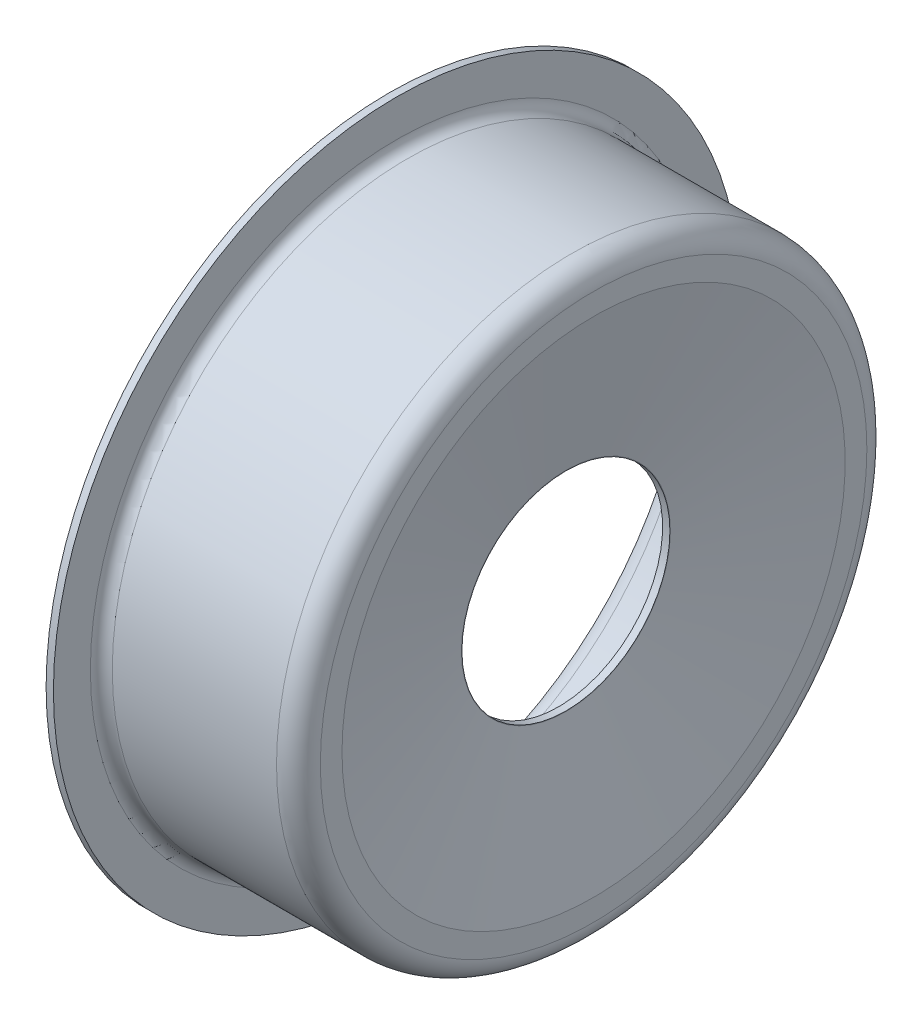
ISO-10303-21;
HEADER;
FILE_DESCRIPTION(('STEP AP214'),'2;1');
FILE_NAME('part.step','',(''),(''),'','','');
FILE_SCHEMA(('AUTOMOTIVE_DESIGN { 1 0 10303 214 1 1 1 1 }'));
ENDSEC;
DATA;
#1=APPLICATION_CONTEXT('core data for automotive mechanical design processes');
#2=APPLICATION_PROTOCOL_DEFINITION('international standard','automotive_design',2000,#1);
#3=PRODUCT_CONTEXT('',#1,'mechanical');
#4=PRODUCT('Part','Part','',(#3));
#5=PRODUCT_RELATED_PRODUCT_CATEGORY('part','',(#4));
#6=PRODUCT_DEFINITION_FORMATION('','',#4);
#7=PRODUCT_DEFINITION_CONTEXT('part definition',#1,'design');
#8=PRODUCT_DEFINITION('design','',#6,#7);
#9=PRODUCT_DEFINITION_SHAPE('','',#8);
#10=(LENGTH_UNIT() NAMED_UNIT(*) SI_UNIT(.MILLI.,.METRE.));
#11=(NAMED_UNIT(*) PLANE_ANGLE_UNIT() SI_UNIT($,.RADIAN.));
#12=(NAMED_UNIT(*) SI_UNIT($,.STERADIAN.) SOLID_ANGLE_UNIT());
#13=UNCERTAINTY_MEASURE_WITH_UNIT(LENGTH_MEASURE(1.E-05),#10,'distance_accuracy_value','');
#14=(GEOMETRIC_REPRESENTATION_CONTEXT(3) GLOBAL_UNCERTAINTY_ASSIGNED_CONTEXT((#13)) GLOBAL_UNIT_ASSIGNED_CONTEXT((#10,
#11,#12)) REPRESENTATION_CONTEXT('',''));
#15=CARTESIAN_POINT('',(0.,0.,0.));
#16=DIRECTION('',(0.,0.,1.));
#17=DIRECTION('',(1.,0.,0.));
#18=AXIS2_PLACEMENT_3D('',#15,#16,#17);
#19=CARTESIAN_POINT('',(76.5,14.3176054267,0.));
#20=DIRECTION('',(1.,0.,0.));
#21=DIRECTION('',(0.,0.,-1.));
#22=AXIS2_PLACEMENT_3D('',#19,#20,#21);
#23=PLANE('',#22);
#24=CARTESIAN_POINT('',(76.5,0.,0.));
#25=DIRECTION('',(-1.,0.,0.));
#26=DIRECTION('',(0.,0.,1.));
#27=AXIS2_PLACEMENT_3D('',#24,#25,#26);
#28=CIRCLE('',#27,14.25);
#29=CARTESIAN_POINT('',(76.5,0.,14.25));
#30=VERTEX_POINT('',#29);
#31=EDGE_CURVE('E78',#30,#30,#28,.T.);
#32=ORIENTED_EDGE('',*,*,#31,.F.);
#33=EDGE_LOOP('',(#32));
#34=FACE_BOUND('',#33,.T.);
#35=CARTESIAN_POINT('',(76.5,0.,0.));
#36=DIRECTION('',(-1.,0.,0.));
#37=DIRECTION('',(0.,0.,1.));
#38=AXIS2_PLACEMENT_3D('',#35,#36,#37);
#39=CIRCLE('',#38,14.4108665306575);
#40=CARTESIAN_POINT('',(76.5,0.,14.4108665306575));
#41=VERTEX_POINT('',#40);
#42=EDGE_CURVE('E10',#41,#41,#39,.T.);
#43=ORIENTED_EDGE('',*,*,#42,.T.);
#44=EDGE_LOOP('',(#43));
#45=FACE_BOUND('',#44,.T.);
#46=ADVANCED_FACE('F29',(#34,#45),#23,.F.);
#47=CARTESIAN_POINT('',(80.2910406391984,0.,0.));
#48=DIRECTION('',(1.,0.,0.));
#49=DIRECTION('',(0.,0.,-1.));
#50=AXIS2_PLACEMENT_3D('',#47,#48,#49);
#51=CONICAL_SURFACE('',#50,34.5589636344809,1.38481208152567);
#52=ORIENTED_EDGE('',*,*,#42,.F.);
#53=EDGE_LOOP('',(#52));
#54=FACE_BOUND('',#53,.T.);
#55=CARTESIAN_POINT('',(80.2910406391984,0.,0.));
#56=DIRECTION('',(-1.,0.,0.));
#57=DIRECTION('',(0.,0.,1.));
#58=AXIS2_PLACEMENT_3D('',#55,#56,#57);
#59=CIRCLE('',#58,34.5589636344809);
#60=CARTESIAN_POINT('',(80.2910406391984,0.,34.5589636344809));
#61=VERTEX_POINT('',#60);
#62=EDGE_CURVE('E36',#61,#61,#59,.T.);
#63=ORIENTED_EDGE('',*,*,#62,.T.);
#64=EDGE_LOOP('',(#63));
#65=FACE_BOUND('',#64,.T.);
#66=ADVANCED_FACE('F148',(#54,#65),#51,.T.);
#67=CARTESIAN_POINT('',(80.2910406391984,37.4355090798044,0.));
#68=DIRECTION('',(1.,0.,0.));
#69=DIRECTION('',(0.,0.,-1.));
#70=AXIS2_PLACEMENT_3D('',#67,#68,#69);
#71=PLANE('',#70);
#72=ORIENTED_EDGE('',*,*,#62,.F.);
#73=EDGE_LOOP('',(#72));
#74=FACE_BOUND('',#73,.T.);
#75=CARTESIAN_POINT('',(80.2910406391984,0.,0.));
#76=DIRECTION('',(-1.,0.,0.));
#77=DIRECTION('',(0.,0.,1.));
#78=AXIS2_PLACEMENT_3D('',#75,#76,#77);
#79=CIRCLE('',#78,37.4355090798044);
#80=CARTESIAN_POINT('',(80.2910406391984,0.,37.4355090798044));
#81=VERTEX_POINT('',#80);
#82=EDGE_CURVE('E40',#81,#81,#79,.T.);
#83=ORIENTED_EDGE('',*,*,#82,.T.);
#84=EDGE_LOOP('',(#83));
#85=FACE_BOUND('',#84,.T.);
#86=ADVANCED_FACE('F153',(#74,#85),#71,.F.);
#87=CARTESIAN_POINT('',(78.2910406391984,0.,0.));
#88=DIRECTION('',(-1.,0.,0.));
#89=DIRECTION('',(0.,0.,1.));
#90=AXIS2_PLACEMENT_3D('',#87,#88,#89);
#91=TOROIDAL_SURFACE('',#90,37.4355090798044,2.);
#92=ORIENTED_EDGE('',*,*,#82,.F.);
#93=EDGE_LOOP('',(#92));
#94=FACE_BOUND('',#93,.T.);
#95=CARTESIAN_POINT('',(78.2910406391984,0.,0.));
#96=DIRECTION('',(-1.,0.,0.));
#97=DIRECTION('',(0.,0.,1.));
#98=AXIS2_PLACEMENT_3D('',#95,#96,#97);
#99=CIRCLE('',#98,39.4355090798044);
#100=CARTESIAN_POINT('',(78.2910406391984,0.,39.4355090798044));
#101=VERTEX_POINT('',#100);
#102=EDGE_CURVE('E45',#101,#101,#99,.T.);
#103=ORIENTED_EDGE('',*,*,#102,.T.);
#104=EDGE_LOOP('',(#103));
#105=FACE_BOUND('',#104,.T.);
#106=ADVANCED_FACE('F158',(#94,#105),#91,.F.);
#107=CARTESIAN_POINT('',(0.,0.,0.));
#108=DIRECTION('',(-1.,0.,0.));
#109=DIRECTION('',(0.,0.,1.));
#110=AXIS2_PLACEMENT_3D('',#107,#108,#109);
#111=CYLINDRICAL_SURFACE('',#110,39.4355090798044);
#112=ORIENTED_EDGE('',*,*,#102,.F.);
#113=EDGE_LOOP('',(#112));
#114=FACE_BOUND('',#113,.T.);
#115=CARTESIAN_POINT('',(55.7910406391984,0.,0.));
#116=DIRECTION('',(-1.,0.,0.));
#117=DIRECTION('',(0.,0.,1.));
#118=AXIS2_PLACEMENT_3D('',#115,#116,#117);
#119=CIRCLE('',#118,39.4355090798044);
#120=CARTESIAN_POINT('',(55.7910406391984,0.,39.4355090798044));
#121=VERTEX_POINT('',#120);
#122=EDGE_CURVE('E48',#121,#121,#119,.T.);
#123=ORIENTED_EDGE('',*,*,#122,.T.);
#124=EDGE_LOOP('',(#123));
#125=FACE_BOUND('',#124,.T.);
#126=ADVANCED_FACE('F143',(#114,#125),#111,.F.);
#127=CARTESIAN_POINT('',(55.7910406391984,0.,0.));
#128=DIRECTION('',(-1.,0.,0.));
#129=DIRECTION('',(0.,0.,1.));
#130=AXIS2_PLACEMENT_3D('',#127,#128,#129);
#131=TOROIDAL_SURFACE('',#130,41.9355090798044,2.5);
#132=ORIENTED_EDGE('',*,*,#122,.F.);
#133=EDGE_LOOP('',(#132));
#134=FACE_BOUND('',#133,.T.);
#135=CARTESIAN_POINT('',(53.2910406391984,0.,0.));
#136=DIRECTION('',(-1.,0.,0.));
#137=DIRECTION('',(0.,0.,1.));
#138=AXIS2_PLACEMENT_3D('',#135,#136,#137);
#139=CIRCLE('',#138,41.9355090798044);
#140=CARTESIAN_POINT('',(53.2910406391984,0.,41.9355090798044));
#141=VERTEX_POINT('',#140);
#142=EDGE_CURVE('E51',#141,#141,#139,.T.);
#143=ORIENTED_EDGE('',*,*,#142,.T.);
#144=EDGE_LOOP('',(#143));
#145=FACE_BOUND('',#144,.T.);
#146=ADVANCED_FACE('F137',(#134,#145),#131,.T.);
#147=CARTESIAN_POINT('',(53.2910406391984,47.,0.));
#148=DIRECTION('',(1.,0.,0.));
#149=DIRECTION('',(0.,0.,-1.));
#150=AXIS2_PLACEMENT_3D('',#147,#148,#149);
#151=PLANE('',#150);
#152=ORIENTED_EDGE('',*,*,#142,.F.);
#153=EDGE_LOOP('',(#152));
#154=FACE_BOUND('',#153,.T.);
#155=CARTESIAN_POINT('',(53.2910406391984,0.,0.));
#156=DIRECTION('',(-1.,0.,0.));
#157=DIRECTION('',(0.,0.,1.));
#158=AXIS2_PLACEMENT_3D('',#155,#156,#157);
#159=CIRCLE('',#158,47.);
#160=CARTESIAN_POINT('',(53.2910406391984,0.,47.));
#161=VERTEX_POINT('',#160);
#162=EDGE_CURVE('E54',#161,#161,#159,.T.);
#163=ORIENTED_EDGE('',*,*,#162,.T.);
#164=EDGE_LOOP('',(#163));
#165=FACE_BOUND('',#164,.T.);
#166=ADVANCED_FACE('F132',(#154,#165),#151,.F.);
#167=CARTESIAN_POINT('',(0.,0.,0.));
#168=DIRECTION('',(-1.,0.,0.));
#169=DIRECTION('',(0.,0.,1.));
#170=AXIS2_PLACEMENT_3D('',#167,#168,#169);
#171=CYLINDRICAL_SURFACE('',#170,47.);
#172=CARTESIAN_POINT('',(54.2910406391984,0.,0.));
#173=DIRECTION('',(-1.,0.,0.));
#174=DIRECTION('',(0.,0.,1.));
#175=AXIS2_PLACEMENT_3D('',#172,#173,#174);
#176=CIRCLE('',#175,47.);
#177=CARTESIAN_POINT('',(54.2910406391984,0.,47.));
#178=VERTEX_POINT('',#177);
#179=EDGE_CURVE('E57',#178,#178,#176,.T.);
#180=ORIENTED_EDGE('',*,*,#179,.T.);
#181=EDGE_LOOP('',(#180));
#182=FACE_BOUND('',#181,.T.);
#183=ORIENTED_EDGE('',*,*,#162,.F.);
#184=EDGE_LOOP('',(#183));
#185=FACE_BOUND('',#184,.T.);
#186=ADVANCED_FACE('F126',(#182,#185),#171,.T.);
#187=CARTESIAN_POINT('',(54.2910406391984,47.,0.));
#188=DIRECTION('',(1.,0.,0.));
#189=DIRECTION('',(0.,0.,-1.));
#190=AXIS2_PLACEMENT_3D('',#187,#188,#189);
#191=PLANE('',#190);
#192=CARTESIAN_POINT('',(54.2910406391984,0.,0.));
#193=DIRECTION('',(-1.,0.,0.));
#194=DIRECTION('',(0.,0.,1.));
#195=AXIS2_PLACEMENT_3D('',#192,#193,#194);
#196=CIRCLE('',#195,41.9355090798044);
#197=CARTESIAN_POINT('',(54.2910406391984,0.,41.9355090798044));
#198=VERTEX_POINT('',#197);
#199=EDGE_CURVE('E60',#198,#198,#196,.T.);
#200=ORIENTED_EDGE('',*,*,#199,.T.);
#201=EDGE_LOOP('',(#200));
#202=FACE_BOUND('',#201,.T.);
#203=ORIENTED_EDGE('',*,*,#179,.F.);
#204=EDGE_LOOP('',(#203));
#205=FACE_BOUND('',#204,.T.);
#206=ADVANCED_FACE('F120',(#202,#205),#191,.T.);
#207=CARTESIAN_POINT('',(55.7910406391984,0.,0.));
#208=DIRECTION('',(-1.,0.,0.));
#209=DIRECTION('',(0.,0.,1.));
#210=AXIS2_PLACEMENT_3D('',#207,#208,#209);
#211=TOROIDAL_SURFACE('',#210,41.9355090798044,1.5);
#212=CARTESIAN_POINT('',(55.7910406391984,0.,0.));
#213=DIRECTION('',(-1.,0.,0.));
#214=DIRECTION('',(0.,0.,1.));
#215=AXIS2_PLACEMENT_3D('',#212,#213,#214);
#216=CIRCLE('',#215,40.4355090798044);
#217=CARTESIAN_POINT('',(55.7910406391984,0.,40.4355090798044));
#218=VERTEX_POINT('',#217);
#219=EDGE_CURVE('E63',#218,#218,#216,.T.);
#220=ORIENTED_EDGE('',*,*,#219,.T.);
#221=EDGE_LOOP('',(#220));
#222=FACE_BOUND('',#221,.T.);
#223=ORIENTED_EDGE('',*,*,#199,.F.);
#224=EDGE_LOOP('',(#223));
#225=FACE_BOUND('',#224,.T.);
#226=ADVANCED_FACE('F114',(#222,#225),#211,.F.);
#227=CARTESIAN_POINT('',(0.,0.,0.));
#228=DIRECTION('',(-1.,0.,0.));
#229=DIRECTION('',(0.,0.,1.));
#230=AXIS2_PLACEMENT_3D('',#227,#228,#229);
#231=CYLINDRICAL_SURFACE('',#230,40.4355090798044);
#232=CARTESIAN_POINT('',(78.2910406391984,0.,0.));
#233=DIRECTION('',(-1.,0.,0.));
#234=DIRECTION('',(0.,0.,1.));
#235=AXIS2_PLACEMENT_3D('',#232,#233,#234);
#236=CIRCLE('',#235,40.4355090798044);
#237=CARTESIAN_POINT('',(78.2910406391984,0.,40.4355090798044));
#238=VERTEX_POINT('',#237);
#239=EDGE_CURVE('E66',#238,#238,#236,.T.);
#240=ORIENTED_EDGE('',*,*,#239,.T.);
#241=EDGE_LOOP('',(#240));
#242=FACE_BOUND('',#241,.T.);
#243=ORIENTED_EDGE('',*,*,#219,.F.);
#244=EDGE_LOOP('',(#243));
#245=FACE_BOUND('',#244,.T.);
#246=ADVANCED_FACE('F108',(#242,#245),#231,.T.);
#247=CARTESIAN_POINT('',(78.2910406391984,0.,0.));
#248=DIRECTION('',(-1.,0.,0.));
#249=DIRECTION('',(0.,0.,1.));
#250=AXIS2_PLACEMENT_3D('',#247,#248,#249);
#251=TOROIDAL_SURFACE('',#250,37.4355090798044,3.);
#252=CARTESIAN_POINT('',(81.2910406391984,0.,0.));
#253=DIRECTION('',(-1.,0.,0.));
#254=DIRECTION('',(0.,0.,1.));
#255=AXIS2_PLACEMENT_3D('',#252,#253,#254);
#256=CIRCLE('',#255,37.4355090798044);
#257=CARTESIAN_POINT('',(81.2910406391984,0.,37.4355090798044));
#258=VERTEX_POINT('',#257);
#259=EDGE_CURVE('E69',#258,#258,#256,.T.);
#260=ORIENTED_EDGE('',*,*,#259,.T.);
#261=EDGE_LOOP('',(#260));
#262=FACE_BOUND('',#261,.T.);
#263=ORIENTED_EDGE('',*,*,#239,.F.);
#264=EDGE_LOOP('',(#263));
#265=FACE_BOUND('',#264,.T.);
#266=ADVANCED_FACE('F102',(#262,#265),#251,.T.);
#267=CARTESIAN_POINT('',(81.2910406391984,37.4355090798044,0.));
#268=DIRECTION('',(1.,0.,0.));
#269=DIRECTION('',(0.,0.,-1.));
#270=AXIS2_PLACEMENT_3D('',#267,#268,#269);
#271=PLANE('',#270);
#272=CARTESIAN_POINT('',(81.2910406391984,0.,0.));
#273=DIRECTION('',(-1.,0.,0.));
#274=DIRECTION('',(0.,0.,1.));
#275=AXIS2_PLACEMENT_3D('',#272,#273,#274);
#276=CIRCLE('',#275,34.4657025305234);
#277=CARTESIAN_POINT('',(81.2910406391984,0.,34.4657025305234));
#278=VERTEX_POINT('',#277);
#279=EDGE_CURVE('E72',#278,#278,#276,.T.);
#280=ORIENTED_EDGE('',*,*,#279,.T.);
#281=EDGE_LOOP('',(#280));
#282=FACE_BOUND('',#281,.T.);
#283=ORIENTED_EDGE('',*,*,#259,.F.);
#284=EDGE_LOOP('',(#283));
#285=FACE_BOUND('',#284,.T.);
#286=ADVANCED_FACE('F96',(#282,#285),#271,.T.);
#287=CARTESIAN_POINT('',(81.2910406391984,0.,0.));
#288=DIRECTION('',(1.,0.,0.));
#289=DIRECTION('',(0.,0.,-1.));
#290=AXIS2_PLACEMENT_3D('',#287,#288,#289);
#291=CONICAL_SURFACE('',#290,34.4657025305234,1.38481208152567);
#292=CARTESIAN_POINT('',(77.5,0.,0.));
#293=DIRECTION('',(-1.,0.,0.));
#294=DIRECTION('',(0.,0.,1.));
#295=AXIS2_PLACEMENT_3D('',#292,#293,#294);
#296=CIRCLE('',#295,14.3176054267);
#297=CARTESIAN_POINT('',(77.5,0.,14.3176054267));
#298=VERTEX_POINT('',#297);
#299=EDGE_CURVE('E75',#298,#298,#296,.T.);
#300=ORIENTED_EDGE('',*,*,#299,.T.);
#301=EDGE_LOOP('',(#300));
#302=FACE_BOUND('',#301,.T.);
#303=ORIENTED_EDGE('',*,*,#279,.F.);
#304=EDGE_LOOP('',(#303));
#305=FACE_BOUND('',#304,.T.);
#306=ADVANCED_FACE('F90',(#302,#305),#291,.F.);
#307=CARTESIAN_POINT('',(77.5,14.3176054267,0.));
#308=DIRECTION('',(1.,0.,0.));
#309=DIRECTION('',(0.,0.,-1.));
#310=AXIS2_PLACEMENT_3D('',#307,#308,#309);
#311=PLANE('',#310);
#312=CARTESIAN_POINT('',(77.5,0.,0.));
#313=DIRECTION('',(1.,0.,0.));
#314=DIRECTION('',(0.,0.,-1.));
#315=AXIS2_PLACEMENT_3D('',#312,#313,#314);
#316=CIRCLE('',#315,14.25);
#317=CARTESIAN_POINT('',(77.5,0.,-14.25));
#318=VERTEX_POINT('',#317);
#319=EDGE_CURVE('E32',#318,#318,#316,.T.);
#320=ORIENTED_EDGE('',*,*,#319,.F.);
#321=EDGE_LOOP('',(#320));
#322=FACE_BOUND('',#321,.T.);
#323=ORIENTED_EDGE('',*,*,#299,.F.);
#324=EDGE_LOOP('',(#323));
#325=FACE_BOUND('',#324,.T.);
#326=ADVANCED_FACE('F87',(#322,#325),#311,.T.);
#327=CARTESIAN_POINT('',(78.811002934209,0.,0.));
#328=DIRECTION('',(-1.,0.,0.));
#329=DIRECTION('',(0.,0.,1.));
#330=AXIS2_PLACEMENT_3D('',#327,#328,#329);
#331=CYLINDRICAL_SURFACE('',#330,14.25);
#332=ORIENTED_EDGE('',*,*,#319,.T.);
#333=EDGE_LOOP('',(#332));
#334=FACE_BOUND('',#333,.T.);
#335=ORIENTED_EDGE('',*,*,#31,.T.);
#336=EDGE_LOOP('',(#335));
#337=FACE_BOUND('',#336,.T.);
#338=ADVANCED_FACE('F85',(#334,#337),#331,.F.);
#339=CLOSED_SHELL('',(#46,#66,#86,#106,#126,#146,#166,#186,#206,#226,#246,#266,#286,#306,#326,#338));
#340=MANIFOLD_SOLID_BREP('B2',#339);
#341=ADVANCED_BREP_SHAPE_REPRESENTATION('',(#18,#340),#14);
#342=SHAPE_DEFINITION_REPRESENTATION(#9,#341);
ENDSEC;
END-ISO-10303-21;
